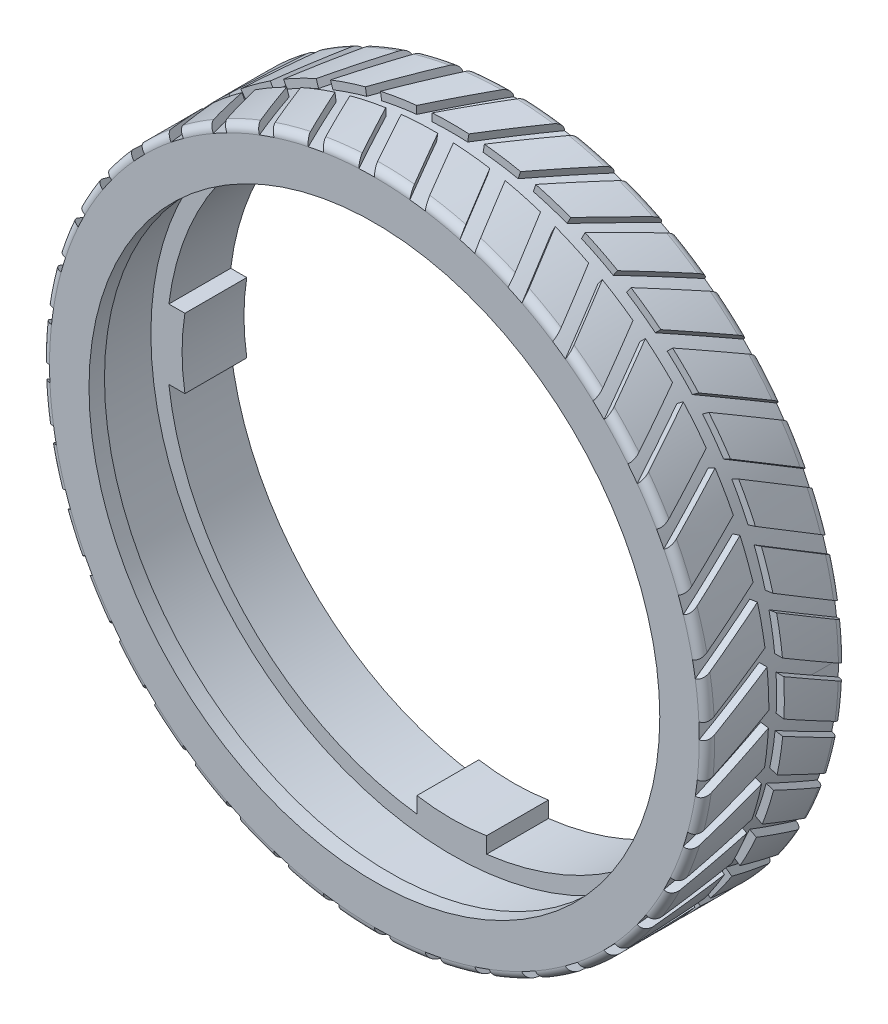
from build123d import *
from build123d.topology import SkipClean

# Parameters (mm, degrees)
ESQUISSE1_R                  = 21.5
ESQUISSE1_R_2                = 19.45
EXTRUSION1_DEPTH             = 9
EXTRUSION2_START             = -1
ESQUISSE2_R                  = 19.45
ESQUISSE2_R_2                = 18.45
EXTRUSION2_DEPTH             = 1
ESQUISSE4_R                  = 19.45
ESQUISSE4_R_2                = 18.425
EXTRUSION3_DEPTH             = 4
EXTRUSION4_DEPTH             = 4
ENL_V_MAT_EXTRU_1_DEPTH      = 0.5
ENL_V_MAT_EXTRU_1_DEPTH_BACK = 0.5
ESQUISSE6_R                  = 21.5
ESQUISSE6_R_2                = 21
CONG_1_R                     = 0.5
ENL_V_MAT_EXTRU_3_REACH      = 53.568
ENL_V_MAT_EXTRU_3_END_RADIUS = 21
R_P_TITION_CIRCULAIRE1_COUNT = 40


with BuildPart() as part:
    # Esquisse1 → Extrusion1 (new body)
    with BuildSketch(Plane.XY):
        Circle(ESQUISSE1_R)
        Circle(ESQUISSE1_R_2, mode=Mode.SUBTRACT)
    extrude(amount=EXTRUSION1_DEPTH)

    # Esquisse2 → Extrusion2 (add)
    with BuildSketch(Plane.XY.offset(9).offset(EXTRUSION2_START)):
        Circle(ESQUISSE2_R)
        Circle(ESQUISSE2_R_2, mode=Mode.SUBTRACT)
    extrude(amount=EXTRUSION2_DEPTH)

    # Esquisse4 → Extrusion3 (add)
    with BuildSketch(Plane(origin=(0, 0, 0), x_dir=(-1, 0, 0), z_dir=(0, 0, -1))):
        Circle(ESQUISSE4_R)
        Circle(ESQUISSE4_R_2, mode=Mode.SUBTRACT)
    extrude(amount=-EXTRUSION3_DEPTH)

    # Esquisse5 → Extrusion4 (add)
    with BuildSketch(Plane(origin=(0, 0, 0), x_dir=(-1, 0, 0), z_dir=(0, 0, -1))):
        with BuildLine():
            Line((-2.25, 18.75061146), (2.25, 18.75061146))
            Line((2.25, 18.75061146), (2.25, 17.25061146))
            ThreePointArc((2.25, 17.25061146), (0, 17.432718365), (-2.25, 17.25061146))
            Line((-2.25, 17.25061146), (-2.25, 18.75061146))
        make_face()
        with BuildLine():
            Line((18.75061146, 2.25), (18.75061146, -2.25))
            Line((18.75061146, -2.25), (17.25061146, -2.25))
            ThreePointArc((17.25061146, -2.25), (17.432718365, 0), (17.25061146, 2.25))
            Line((17.25061146, 2.25), (18.75061146, 2.25))
        make_face()
        with BuildLine():
            Line((2.25, -18.75061146), (-2.25, -18.75061146))
            Line((-2.25, -18.75061146), (-2.25, -17.25061146))
            ThreePointArc((-2.25, -17.25061146), (0, -17.432718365), (2.25, -17.25061146))
            Line((2.25, -17.25061146), (2.25, -18.75061146))
        make_face()
        with BuildLine():
            Line((-18.75061146, -2.25), (-18.75061146, 2.25))
            Line((-18.75061146, 2.25), (-17.25061146, 2.25))
            ThreePointArc((-17.25061146, 2.25), (-17.432718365, 0), (-17.25061146, -2.25))
            Line((-17.25061146, -2.25), (-18.75061146, -2.25))
        make_face()
    extrude(amount=-EXTRUSION4_DEPTH)

    # Esquisse6 → Enl_v. mat.-Extru.1 (cut, two sides: drawn at the far end of the back side and taken through both)
    with BuildSketch(Plane.XY.offset(4.5).offset(-ENL_V_MAT_EXTRU_1_DEPTH_BACK)):
        Circle(ESQUISSE6_R)
        Circle(ESQUISSE6_R_2, mode=Mode.SUBTRACT)
    extrude(amount=ENL_V_MAT_EXTRU_1_DEPTH + ENL_V_MAT_EXTRU_1_DEPTH_BACK, mode=Mode.SUBTRACT)

    # Cong_1
    cong_1_edges = [part.edges().sort_by_distance(p)[0] for p in [
        (-21.5, 0, 0),
        (-21.5, 0, 9),
    ]]
    fillet(cong_1_edges, radius=CONG_1_R)

    # Enl_v. mat.-Extru.3: up to this cylinder (the profile starts outside it)
    with SkipClean():  # the faces are left unmerged after this step: merging them gives an invalid solid
        enl_v_mat_extru_3_end = Plane(origin=(0, 0, 4.5), z_dir=(0, 0, 1)) * Cylinder(ENL_V_MAT_EXTRU_3_END_RADIUS, 154.82013, mode=Mode.PRIVATE)
        # Esquisse7 → Enl_v. mat.-Extru.3 (cut, up to the surface)
        with BuildSketch(Plane(origin=(24.5, 0, 0), x_dir=(0, 0, -1), z_dir=(1, 0, 0)), mode=Mode.PRIVATE) as enl_v_mat_extru_3_sk1:
            Polygon((-9, 0), (-4.684130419, 2.442952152), (-4.684130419, 3.442952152), (-9, 1), align=None)
        enl_v_mat_extru_3_tool1 = extrude(enl_v_mat_extru_3_sk1.sketch, amount=-ENL_V_MAT_EXTRU_3_REACH, mode=Mode.PRIVATE) - enl_v_mat_extru_3_end
        # Esquisse7 → Enl_v. mat.-Extru.3 (cut, up to the surface)
        with BuildSketch(Plane(origin=(24.5, 0, 0), x_dir=(0, 0, -1), z_dir=(1, 0, 0)), mode=Mode.PRIVATE) as enl_v_mat_extru_3_sk2:
            Polygon((-4.315869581, 2.442952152), (-4.315869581, 1.442952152), (0, -1), (0, 0), align=None)
        enl_v_mat_extru_3_tool2 = extrude(enl_v_mat_extru_3_sk2.sketch, amount=-ENL_V_MAT_EXTRU_3_REACH, mode=Mode.PRIVATE) - enl_v_mat_extru_3_end
        enl_v_mat_extru_3 = enl_v_mat_extru_3_tool1.solids().sort_by_distance((24.5, 1.721476, 6.842065))[0] + enl_v_mat_extru_3_tool2.solids().sort_by_distance((24.5, 0.721476, 2.157935))[0]
        add(enl_v_mat_extru_3, mode=Mode.SUBTRACT)

    # R_p_tition circulaire1: Enl_v. mat.-Extru.3 ×40 about axis
    with SkipClean():  # the faces are left unmerged after this step: merging them gives an invalid solid
        r_p_tition_circulaire1_axis = Axis((0, 0, 0), (0, 0, 1))
        for i in range(1, R_P_TITION_CIRCULAIRE1_COUNT):
            add(enl_v_mat_extru_3.rotate(r_p_tition_circulaire1_axis, i * 360 / R_P_TITION_CIRCULAIRE1_COUNT), mode=Mode.SUBTRACT)


solid = part.part
